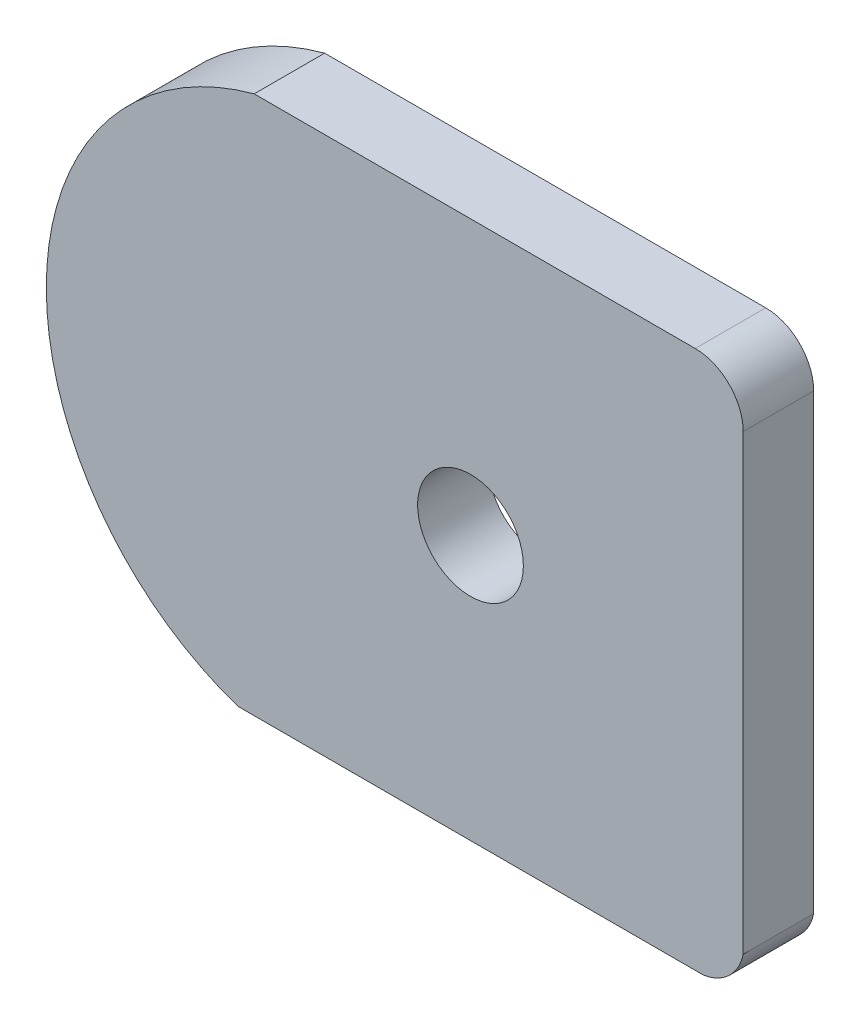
ISO-10303-21;
HEADER;
FILE_DESCRIPTION(('STEP AP214'),'2;1');
FILE_NAME('part.step','',(''),(''),'','','');
FILE_SCHEMA(('AUTOMOTIVE_DESIGN { 1 0 10303 214 1 1 1 1 }'));
ENDSEC;
DATA;
#1=APPLICATION_CONTEXT('core data for automotive mechanical design processes');
#2=APPLICATION_PROTOCOL_DEFINITION('international standard','automotive_design',2000,#1);
#3=PRODUCT_CONTEXT('',#1,'mechanical');
#4=PRODUCT('Part','Part','',(#3));
#5=PRODUCT_RELATED_PRODUCT_CATEGORY('part','',(#4));
#6=PRODUCT_DEFINITION_FORMATION('','',#4);
#7=PRODUCT_DEFINITION_CONTEXT('part definition',#1,'design');
#8=PRODUCT_DEFINITION('design','',#6,#7);
#9=PRODUCT_DEFINITION_SHAPE('','',#8);
#10=(LENGTH_UNIT() NAMED_UNIT(*) SI_UNIT(.MILLI.,.METRE.));
#11=(NAMED_UNIT(*) PLANE_ANGLE_UNIT() SI_UNIT($,.RADIAN.));
#12=(NAMED_UNIT(*) SI_UNIT($,.STERADIAN.) SOLID_ANGLE_UNIT());
#13=UNCERTAINTY_MEASURE_WITH_UNIT(LENGTH_MEASURE(1.E-05),#10,'distance_accuracy_value','');
#14=(GEOMETRIC_REPRESENTATION_CONTEXT(3) GLOBAL_UNCERTAINTY_ASSIGNED_CONTEXT((#13)) GLOBAL_UNIT_ASSIGNED_CONTEXT((#10,
#11,#12)) REPRESENTATION_CONTEXT('',''));
#15=CARTESIAN_POINT('',(0.,0.,0.));
#16=DIRECTION('',(0.,0.,1.));
#17=DIRECTION('',(1.,0.,0.));
#18=AXIS2_PLACEMENT_3D('',#15,#16,#17);
#19=CARTESIAN_POINT('',(-5.13962065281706,0.0888951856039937,2.54));
#20=DIRECTION('',(0.,0.,-1.));
#21=DIRECTION('',(-1.,0.,0.));
#22=AXIS2_PLACEMENT_3D('',#19,#20,#21);
#23=CYLINDRICAL_SURFACE('',#22,10.1464390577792);
#24=CARTESIAN_POINT('',(-5.13962065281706,0.0888951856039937,0.));
#25=DIRECTION('',(0.,0.,1.));
#26=DIRECTION('',(1.,0.,0.));
#27=AXIS2_PLACEMENT_3D('',#24,#25,#26);
#28=CIRCLE('',#27,10.1464390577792);
#29=CARTESIAN_POINT('',(-7.79590356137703,9.88146311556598,0.));
#30=VERTEX_POINT('',#29);
#31=CARTESIAN_POINT('',(-8.383575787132,-9.525,0.));
#32=VERTEX_POINT('',#31);
#33=EDGE_CURVE('E118',#30,#32,#28,.T.);
#34=ORIENTED_EDGE('',*,*,#33,.T.);
#35=DIRECTION('',(0.,0.,-1.));
#36=VECTOR('',#35,1.);
#37=CARTESIAN_POINT('',(-8.383575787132,-9.525,2.54));
#38=LINE('',#37,#36);
#39=CARTESIAN_POINT('',(-8.383575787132,-9.525,2.54));
#40=VERTEX_POINT('',#39);
#41=EDGE_CURVE('E11',#40,#32,#38,.T.);
#42=ORIENTED_EDGE('',*,*,#41,.F.);
#43=CARTESIAN_POINT('',(-5.13962065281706,0.0888951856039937,2.54));
#44=DIRECTION('',(0.,0.,1.));
#45=DIRECTION('',(1.,0.,0.));
#46=AXIS2_PLACEMENT_3D('',#43,#44,#45);
#47=CIRCLE('',#46,10.1464390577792);
#48=CARTESIAN_POINT('',(-7.79590356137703,9.88146311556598,2.54));
#49=VERTEX_POINT('',#48);
#50=EDGE_CURVE('E128',#49,#40,#47,.T.);
#51=ORIENTED_EDGE('',*,*,#50,.F.);
#52=DIRECTION('',(0.,0.,-1.));
#53=VECTOR('',#52,1.);
#54=CARTESIAN_POINT('',(-7.79590356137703,9.88146311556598,2.54));
#55=LINE('',#54,#53);
#56=EDGE_CURVE('E114',#49,#30,#55,.T.);
#57=ORIENTED_EDGE('',*,*,#56,.T.);
#58=EDGE_LOOP('',(#34,#42,#51,#57));
#59=FACE_BOUND('',#58,.T.);
#60=ADVANCED_FACE('F33',(#59),#23,.T.);
#61=CARTESIAN_POINT('',(8.39911696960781,-9.52499999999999,2.54));
#62=DIRECTION('',(0.,1.,0.));
#63=DIRECTION('',(-1.,0.,0.));
#64=AXIS2_PLACEMENT_3D('',#61,#62,#63);
#65=PLANE('',#64);
#66=DIRECTION('',(1.,0.,0.));
#67=VECTOR('',#66,1.);
#68=CARTESIAN_POINT('',(8.39911696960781,-9.52499999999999,0.));
#69=LINE('',#68,#67);
#70=CARTESIAN_POINT('',(8.39911696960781,-9.52499999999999,0.));
#71=VERTEX_POINT('',#70);
#72=EDGE_CURVE('E121',#32,#71,#69,.T.);
#73=ORIENTED_EDGE('',*,*,#72,.T.);
#74=DIRECTION('',(0.,0.,-1.));
#75=VECTOR('',#74,1.);
#76=CARTESIAN_POINT('',(8.39911696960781,-9.52499999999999,2.54));
#77=LINE('',#76,#75);
#78=CARTESIAN_POINT('',(8.39911696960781,-9.52499999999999,2.54));
#79=VERTEX_POINT('',#78);
#80=EDGE_CURVE('E42',#79,#71,#77,.T.);
#81=ORIENTED_EDGE('',*,*,#80,.F.);
#82=DIRECTION('',(1.,0.,0.));
#83=VECTOR('',#82,1.);
#84=CARTESIAN_POINT('',(8.39911696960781,-9.52499999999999,2.54));
#85=LINE('',#84,#83);
#86=EDGE_CURVE('E87',#40,#79,#85,.T.);
#87=ORIENTED_EDGE('',*,*,#86,.F.);
#88=ORIENTED_EDGE('',*,*,#41,.T.);
#89=EDGE_LOOP('',(#73,#81,#87,#88));
#90=FACE_BOUND('',#89,.T.);
#91=ADVANCED_FACE('F154',(#90),#65,.F.);
#92=CARTESIAN_POINT('',(8.13131955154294,-7.81676727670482,2.54));
#93=DIRECTION('',(0.,0.,-1.));
#94=DIRECTION('',(-1.,0.,0.));
#95=AXIS2_PLACEMENT_3D('',#92,#93,#94);
#96=CYLINDRICAL_SURFACE('',#95,1.72909643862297);
#97=CARTESIAN_POINT('',(8.13131955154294,-7.81676727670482,0.));
#98=DIRECTION('',(0.,0.,1.));
#99=DIRECTION('',(-1.,0.,0.));
#100=AXIS2_PLACEMENT_3D('',#97,#98,#99);
#101=CIRCLE('',#100,1.72909643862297);
#102=CARTESIAN_POINT('',(9.82650129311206,-8.15755072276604,0.));
#103=VERTEX_POINT('',#102);
#104=EDGE_CURVE('E123',#71,#103,#101,.T.);
#105=ORIENTED_EDGE('',*,*,#104,.T.);
#106=DIRECTION('',(0.,0.,-1.));
#107=VECTOR('',#106,1.);
#108=CARTESIAN_POINT('',(9.82650129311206,-8.15755072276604,2.54));
#109=LINE('',#108,#107);
#110=CARTESIAN_POINT('',(9.82650129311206,-8.15755072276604,2.54));
#111=VERTEX_POINT('',#110);
#112=EDGE_CURVE('E109',#111,#103,#109,.T.);
#113=ORIENTED_EDGE('',*,*,#112,.F.);
#114=CARTESIAN_POINT('',(8.13131955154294,-7.81676727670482,2.54));
#115=DIRECTION('',(0.,0.,1.));
#116=DIRECTION('',(-1.,0.,0.));
#117=AXIS2_PLACEMENT_3D('',#114,#115,#116);
#118=CIRCLE('',#117,1.72909643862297);
#119=EDGE_CURVE('E100',#79,#111,#118,.T.);
#120=ORIENTED_EDGE('',*,*,#119,.F.);
#121=ORIENTED_EDGE('',*,*,#80,.T.);
#122=EDGE_LOOP('',(#105,#113,#120,#121));
#123=FACE_BOUND('',#122,.T.);
#124=ADVANCED_FACE('F135',(#123),#96,.T.);
#125=CARTESIAN_POINT('',(9.82650129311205,8.15236667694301,2.54));
#126=DIRECTION('',(-1.,0.,0.));
#127=DIRECTION('',(0.,-1.,0.));
#128=AXIS2_PLACEMENT_3D('',#125,#126,#127);
#129=PLANE('',#128);
#130=DIRECTION('',(0.,1.,0.));
#131=VECTOR('',#130,1.);
#132=CARTESIAN_POINT('',(9.82650129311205,8.15236667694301,0.));
#133=LINE('',#132,#131);
#134=CARTESIAN_POINT('',(9.82650129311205,8.15236667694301,0.));
#135=VERTEX_POINT('',#134);
#136=EDGE_CURVE('E108',#103,#135,#133,.T.);
#137=ORIENTED_EDGE('',*,*,#136,.T.);
#138=DIRECTION('',(0.,0.,-1.));
#139=VECTOR('',#138,1.);
#140=CARTESIAN_POINT('',(9.82650129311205,8.15236667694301,2.54));
#141=LINE('',#140,#139);
#142=CARTESIAN_POINT('',(9.82650129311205,8.15236667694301,2.54));
#143=VERTEX_POINT('',#142);
#144=EDGE_CURVE('E105',#143,#135,#141,.T.);
#145=ORIENTED_EDGE('',*,*,#144,.F.);
#146=DIRECTION('',(0.,1.,0.));
#147=VECTOR('',#146,1.);
#148=CARTESIAN_POINT('',(9.82650129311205,8.15236667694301,2.54));
#149=LINE('',#148,#147);
#150=EDGE_CURVE('E94',#111,#143,#149,.T.);
#151=ORIENTED_EDGE('',*,*,#150,.F.);
#152=ORIENTED_EDGE('',*,*,#112,.T.);
#153=EDGE_LOOP('',(#137,#145,#151,#152));
#154=FACE_BOUND('',#153,.T.);
#155=ADVANCED_FACE('F106',(#154),#129,.F.);
#156=CARTESIAN_POINT('',(8.09740485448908,8.15236667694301,2.54));
#157=DIRECTION('',(0.,0.,-1.));
#158=DIRECTION('',(-1.,0.,0.));
#159=AXIS2_PLACEMENT_3D('',#156,#157,#158);
#160=CYLINDRICAL_SURFACE('',#159,1.72909643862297);
#161=CARTESIAN_POINT('',(8.09740485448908,8.15236667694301,0.));
#162=DIRECTION('',(0.,0.,1.));
#163=DIRECTION('',(-1.,0.,0.));
#164=AXIS2_PLACEMENT_3D('',#161,#162,#163);
#165=CIRCLE('',#164,1.72909643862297);
#166=CARTESIAN_POINT('',(8.09740485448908,9.88146311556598,0.));
#167=VERTEX_POINT('',#166);
#168=EDGE_CURVE('E73',#135,#167,#165,.T.);
#169=ORIENTED_EDGE('',*,*,#168,.T.);
#170=DIRECTION('',(0.,0.,-1.));
#171=VECTOR('',#170,1.);
#172=CARTESIAN_POINT('',(8.09740485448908,9.88146311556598,2.54));
#173=LINE('',#172,#171);
#174=CARTESIAN_POINT('',(8.09740485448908,9.88146311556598,2.54));
#175=VERTEX_POINT('',#174);
#176=EDGE_CURVE('E110',#175,#167,#173,.T.);
#177=ORIENTED_EDGE('',*,*,#176,.F.);
#178=CARTESIAN_POINT('',(8.09740485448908,8.15236667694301,2.54));
#179=DIRECTION('',(0.,0.,1.));
#180=DIRECTION('',(-1.,0.,0.));
#181=AXIS2_PLACEMENT_3D('',#178,#179,#180);
#182=CIRCLE('',#181,1.72909643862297);
#183=EDGE_CURVE('E98',#143,#175,#182,.T.);
#184=ORIENTED_EDGE('',*,*,#183,.F.);
#185=ORIENTED_EDGE('',*,*,#144,.T.);
#186=EDGE_LOOP('',(#169,#177,#184,#185));
#187=FACE_BOUND('',#186,.T.);
#188=ADVANCED_FACE('F112',(#187),#160,.T.);
#189=CARTESIAN_POINT('',(8.09740485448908,9.88146311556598,2.54));
#190=DIRECTION('',(0.,-1.,0.));
#191=DIRECTION('',(1.,0.,0.));
#192=AXIS2_PLACEMENT_3D('',#189,#190,#191);
#193=PLANE('',#192);
#194=DIRECTION('',(-1.,0.,0.));
#195=VECTOR('',#194,1.);
#196=CARTESIAN_POINT('',(8.09740485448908,9.88146311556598,0.));
#197=LINE('',#196,#195);
#198=EDGE_CURVE('E79',#167,#30,#197,.T.);
#199=ORIENTED_EDGE('',*,*,#198,.T.);
#200=ORIENTED_EDGE('',*,*,#56,.F.);
#201=DIRECTION('',(-1.,0.,0.));
#202=VECTOR('',#201,1.);
#203=CARTESIAN_POINT('',(8.09740485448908,9.88146311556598,2.54));
#204=LINE('',#203,#202);
#205=EDGE_CURVE('E50',#175,#49,#204,.T.);
#206=ORIENTED_EDGE('',*,*,#205,.F.);
#207=ORIENTED_EDGE('',*,*,#176,.T.);
#208=EDGE_LOOP('',(#199,#200,#206,#207));
#209=FACE_BOUND('',#208,.T.);
#210=ADVANCED_FACE('F142',(#209),#193,.F.);
#211=CARTESIAN_POINT('',(-5.13962065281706,0.0888951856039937,2.54));
#212=DIRECTION('',(0.,0.,1.));
#213=DIRECTION('',(1.,0.,0.));
#214=AXIS2_PLACEMENT_3D('',#211,#212,#213);
#215=PLANE('',#214);
#216=CARTESIAN_POINT('',(0.,0.,2.54));
#217=DIRECTION('',(0.,0.,1.));
#218=DIRECTION('',(1.,0.,0.));
#219=AXIS2_PLACEMENT_3D('',#216,#217,#218);
#220=CIRCLE('',#219,1.905);
#221=CARTESIAN_POINT('',(1.905,0.,2.54));
#222=VERTEX_POINT('',#221);
#223=EDGE_CURVE('E207',#222,#222,#220,.T.);
#224=ORIENTED_EDGE('',*,*,#223,.F.);
#225=EDGE_LOOP('',(#224));
#226=FACE_BOUND('',#225,.T.);
#227=ORIENTED_EDGE('',*,*,#50,.T.);
#228=ORIENTED_EDGE('',*,*,#86,.T.);
#229=ORIENTED_EDGE('',*,*,#119,.T.);
#230=ORIENTED_EDGE('',*,*,#150,.T.);
#231=ORIENTED_EDGE('',*,*,#183,.T.);
#232=ORIENTED_EDGE('',*,*,#205,.T.);
#233=EDGE_LOOP('',(#227,#228,#229,#230,#231,#232));
#234=FACE_BOUND('',#233,.T.);
#235=ADVANCED_FACE('F96',(#226,#234),#215,.T.);
#236=CARTESIAN_POINT('',(-5.13962065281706,0.0888951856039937,0.));
#237=DIRECTION('',(0.,0.,1.));
#238=DIRECTION('',(1.,0.,0.));
#239=AXIS2_PLACEMENT_3D('',#236,#237,#238);
#240=PLANE('',#239);
#241=CARTESIAN_POINT('',(0.,0.,0.));
#242=DIRECTION('',(0.,0.,1.));
#243=DIRECTION('',(1.,0.,0.));
#244=AXIS2_PLACEMENT_3D('',#241,#242,#243);
#245=CIRCLE('',#244,1.905);
#246=CARTESIAN_POINT('',(1.905,0.,0.));
#247=VERTEX_POINT('',#246);
#248=EDGE_CURVE('E36',#247,#247,#245,.F.);
#249=ORIENTED_EDGE('',*,*,#248,.F.);
#250=EDGE_LOOP('',(#249));
#251=FACE_BOUND('',#250,.T.);
#252=ORIENTED_EDGE('',*,*,#33,.F.);
#253=ORIENTED_EDGE('',*,*,#198,.F.);
#254=ORIENTED_EDGE('',*,*,#168,.F.);
#255=ORIENTED_EDGE('',*,*,#136,.F.);
#256=ORIENTED_EDGE('',*,*,#104,.F.);
#257=ORIENTED_EDGE('',*,*,#72,.F.);
#258=EDGE_LOOP('',(#252,#253,#254,#255,#256,#257));
#259=FACE_BOUND('',#258,.T.);
#260=ADVANCED_FACE('F138',(#251,#259),#240,.F.);
#261=CARTESIAN_POINT('',(0.,0.,2.54));
#262=DIRECTION('',(0.,0.,-1.));
#263=DIRECTION('',(-1.,0.,0.));
#264=AXIS2_PLACEMENT_3D('',#261,#262,#263);
#265=CYLINDRICAL_SURFACE('',#264,1.905);
#266=ORIENTED_EDGE('',*,*,#223,.T.);
#267=EDGE_LOOP('',(#266));
#268=FACE_BOUND('',#267,.T.);
#269=ORIENTED_EDGE('',*,*,#248,.T.);
#270=EDGE_LOOP('',(#269));
#271=FACE_BOUND('',#270,.T.);
#272=ADVANCED_FACE('F191',(#268,#271),#265,.F.);
#273=CLOSED_SHELL('',(#60,#91,#124,#155,#188,#210,#235,#260,#272));
#274=MANIFOLD_SOLID_BREP('B2',#273);
#275=ADVANCED_BREP_SHAPE_REPRESENTATION('',(#18,#274),#14);
#276=SHAPE_DEFINITION_REPRESENTATION(#9,#275);
ENDSEC;
END-ISO-10303-21;
